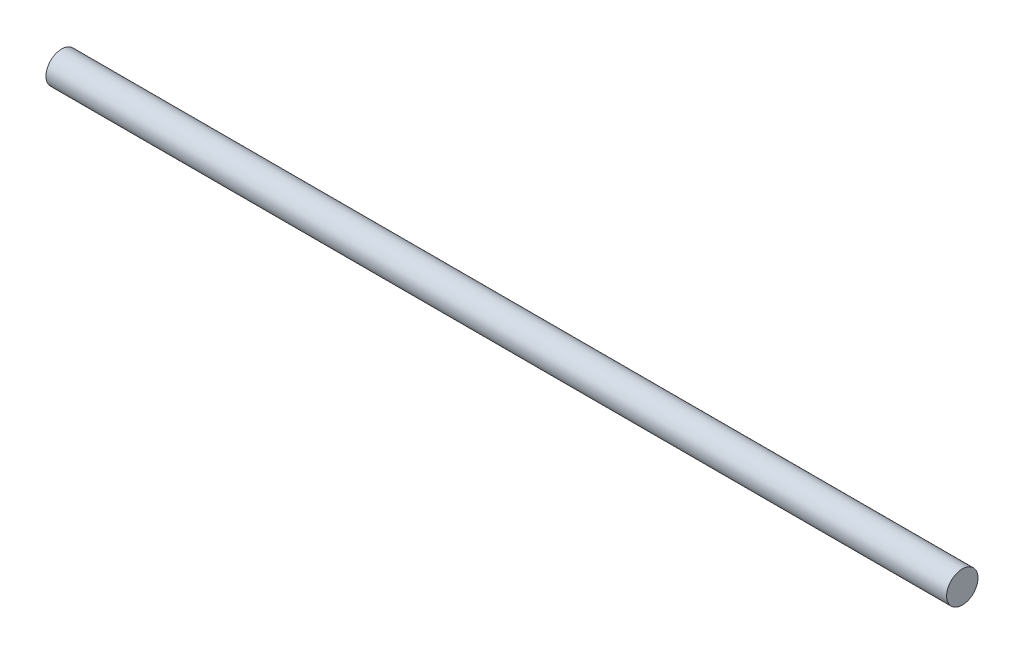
ISO-10303-21;
HEADER;
FILE_DESCRIPTION(('STEP AP214'),'2;1');
FILE_NAME('part.step','',(''),(''),'','','');
FILE_SCHEMA(('AUTOMOTIVE_DESIGN { 1 0 10303 214 1 1 1 1 }'));
ENDSEC;
DATA;
#1=APPLICATION_CONTEXT('core data for automotive mechanical design processes');
#2=APPLICATION_PROTOCOL_DEFINITION('international standard','automotive_design',2000,#1);
#3=PRODUCT_CONTEXT('',#1,'mechanical');
#4=PRODUCT('Part','Part','',(#3));
#5=PRODUCT_RELATED_PRODUCT_CATEGORY('part','',(#4));
#6=PRODUCT_DEFINITION_FORMATION('','',#4);
#7=PRODUCT_DEFINITION_CONTEXT('part definition',#1,'design');
#8=PRODUCT_DEFINITION('design','',#6,#7);
#9=PRODUCT_DEFINITION_SHAPE('','',#8);
#10=(LENGTH_UNIT() NAMED_UNIT(*) SI_UNIT(.MILLI.,.METRE.));
#11=(NAMED_UNIT(*) PLANE_ANGLE_UNIT() SI_UNIT($,.RADIAN.));
#12=(NAMED_UNIT(*) SI_UNIT($,.STERADIAN.) SOLID_ANGLE_UNIT());
#13=UNCERTAINTY_MEASURE_WITH_UNIT(LENGTH_MEASURE(1.E-05),#10,'distance_accuracy_value','');
#14=(GEOMETRIC_REPRESENTATION_CONTEXT(3) GLOBAL_UNCERTAINTY_ASSIGNED_CONTEXT((#13)) GLOBAL_UNIT_ASSIGNED_CONTEXT((#10,
#11,#12)) REPRESENTATION_CONTEXT('',''));
#15=CARTESIAN_POINT('',(0.,0.,0.));
#16=DIRECTION('',(0.,0.,1.));
#17=DIRECTION('',(1.,0.,0.));
#18=AXIS2_PLACEMENT_3D('',#15,#16,#17);
#19=CARTESIAN_POINT('',(172.02,0.,0.));
#20=DIRECTION('',(-1.,0.,0.));
#21=DIRECTION('',(0.,0.,1.));
#22=AXIS2_PLACEMENT_3D('',#19,#20,#21);
#23=CYLINDRICAL_SURFACE('',#22,3.);
#24=CARTESIAN_POINT('',(172.02,0.,0.));
#25=DIRECTION('',(1.,0.,0.));
#26=DIRECTION('',(0.,0.,-1.));
#27=AXIS2_PLACEMENT_3D('',#24,#25,#26);
#28=CIRCLE('',#27,3.);
#29=CARTESIAN_POINT('',(172.02,0.,-3.));
#30=VERTEX_POINT('',#29);
#31=EDGE_CURVE('E10',#30,#30,#28,.T.);
#32=ORIENTED_EDGE('',*,*,#31,.F.);
#33=EDGE_LOOP('',(#32));
#34=FACE_BOUND('',#33,.T.);
#35=CARTESIAN_POINT('',(0.,0.,0.));
#36=DIRECTION('',(1.,0.,0.));
#37=DIRECTION('',(0.,0.,-1.));
#38=AXIS2_PLACEMENT_3D('',#35,#36,#37);
#39=CIRCLE('',#38,3.);
#40=CARTESIAN_POINT('',(0.,0.,-3.));
#41=VERTEX_POINT('',#40);
#42=EDGE_CURVE('E32',#41,#41,#39,.T.);
#43=ORIENTED_EDGE('',*,*,#42,.T.);
#44=EDGE_LOOP('',(#43));
#45=FACE_BOUND('',#44,.T.);
#46=ADVANCED_FACE('F29',(#34,#45),#23,.T.);
#47=CARTESIAN_POINT('',(172.02,0.,0.));
#48=DIRECTION('',(1.,0.,0.));
#49=DIRECTION('',(0.,0.,-1.));
#50=AXIS2_PLACEMENT_3D('',#47,#48,#49);
#51=PLANE('',#50);
#52=ORIENTED_EDGE('',*,*,#31,.T.);
#53=EDGE_LOOP('',(#52));
#54=FACE_BOUND('',#53,.T.);
#55=ADVANCED_FACE('F44',(#54),#51,.T.);
#56=CARTESIAN_POINT('',(0.,0.,0.));
#57=DIRECTION('',(1.,0.,0.));
#58=DIRECTION('',(0.,0.,-1.));
#59=AXIS2_PLACEMENT_3D('',#56,#57,#58);
#60=PLANE('',#59);
#61=ORIENTED_EDGE('',*,*,#42,.F.);
#62=EDGE_LOOP('',(#61));
#63=FACE_BOUND('',#62,.T.);
#64=ADVANCED_FACE('F42',(#63),#60,.F.);
#65=CLOSED_SHELL('',(#46,#55,#64));
#66=MANIFOLD_SOLID_BREP('B2',#65);
#67=ADVANCED_BREP_SHAPE_REPRESENTATION('',(#18,#66),#14);
#68=SHAPE_DEFINITION_REPRESENTATION(#9,#67);
ENDSEC;
END-ISO-10303-21;
